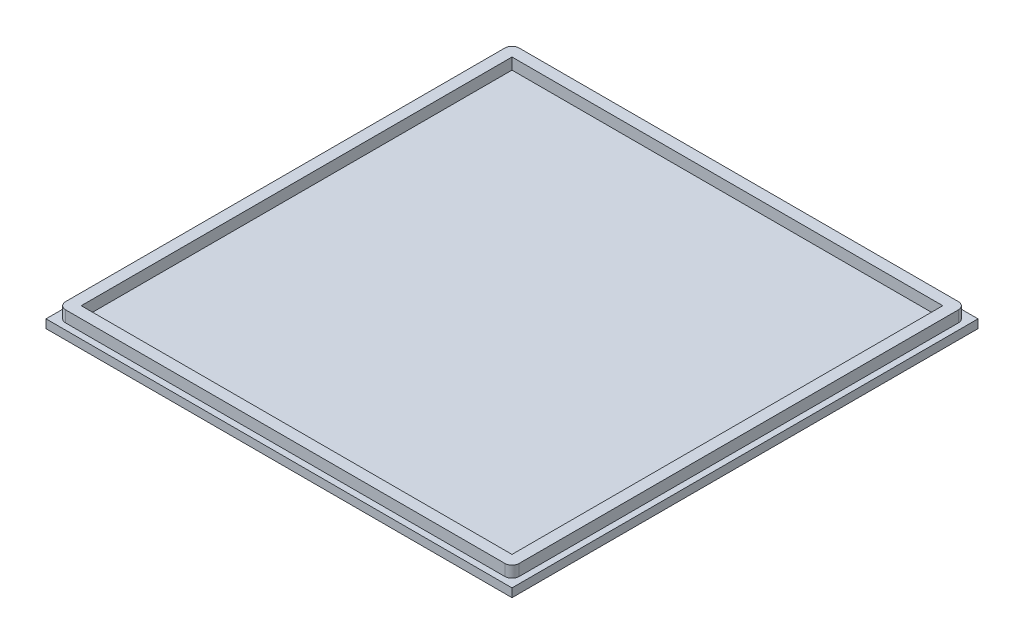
from build123d import *

# Parameters (mm, degrees)
SKETCH1_W           = 164
SKETCH1_H           = 164
BOSS_EXTRUDE1_DEPTH = 3
SKETCH2_W           = 151.6
SKETCH2_H           = 151.6
EXTRUDE_THIN1_DEPTH = 4


with BuildPart() as part:
    # Sketch1 → Boss-Extrude1 (new body)
    with BuildSketch(Plane(origin=(0, 0, 0), x_dir=(1, 0, 0), z_dir=(0, 1, 0))):
        Rectangle(SKETCH1_W, SKETCH1_H)
    extrude(amount=BOSS_EXTRUDE1_DEPTH)

    # Sketch2 → Extrude-Thin1 (add)
    with BuildSketch(Plane(origin=(0, 3, 0), x_dir=(1, 0, 0), z_dir=(0, 1, 0))):
        with BuildLine():
            Line((-79.8, 77.3), (-79.8, -77.3))
            ThreePointArc((-79.8, -77.3), (-79.067766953, -79.067766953), (-77.3, -79.8))
            Line((-77.3, -79.8), (77.3, -79.8))
            ThreePointArc((77.3, -79.8), (79.067766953, -79.067766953), (79.8, -77.3))
            Line((79.8, -77.3), (79.8, 77.3))
            ThreePointArc((79.8, 77.3), (79.067766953, 79.067766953), (77.3, 79.8))
            Line((77.3, 79.8), (-77.3, 79.8))
            ThreePointArc((-77.3, 79.8), (-79.067766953, 79.067766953), (-79.8, 77.3))
        make_face()
        Rectangle(SKETCH2_W, SKETCH2_H, mode=Mode.SUBTRACT)
    extrude(amount=EXTRUDE_THIN1_DEPTH)


solid = part.part
